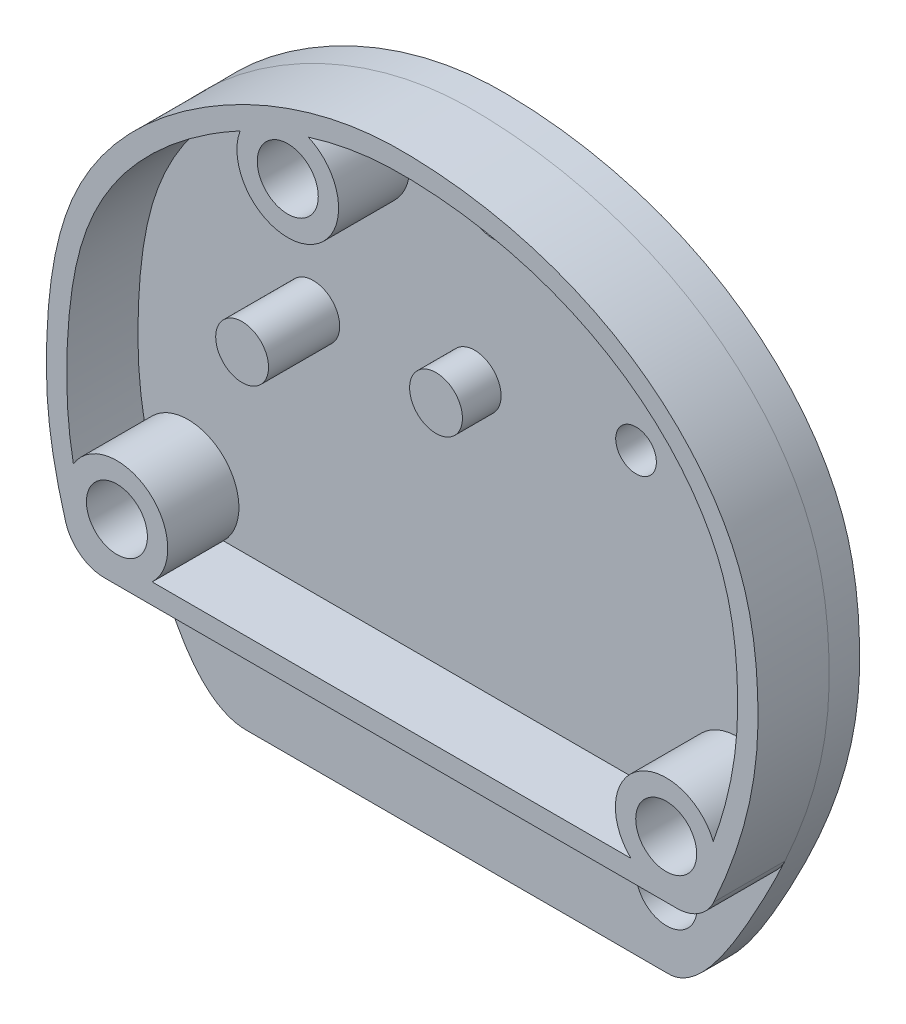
ISO-10303-21;
HEADER;
FILE_DESCRIPTION(('STEP AP214'),'2;1');
FILE_NAME('part.step','',(''),(''),'','','');
FILE_SCHEMA(('AUTOMOTIVE_DESIGN { 1 0 10303 214 1 1 1 1 }'));
ENDSEC;
DATA;
#1=APPLICATION_CONTEXT('core data for automotive mechanical design processes');
#2=APPLICATION_PROTOCOL_DEFINITION('international standard','automotive_design',2000,#1);
#3=PRODUCT_CONTEXT('',#1,'mechanical');
#4=PRODUCT('Part','Part','',(#3));
#5=PRODUCT_RELATED_PRODUCT_CATEGORY('part','',(#4));
#6=PRODUCT_DEFINITION_FORMATION('','',#4);
#7=PRODUCT_DEFINITION_CONTEXT('part definition',#1,'design');
#8=PRODUCT_DEFINITION('design','',#6,#7);
#9=PRODUCT_DEFINITION_SHAPE('','',#8);
#10=(LENGTH_UNIT() NAMED_UNIT(*) SI_UNIT(.MILLI.,.METRE.));
#11=(NAMED_UNIT(*) PLANE_ANGLE_UNIT() SI_UNIT($,.RADIAN.));
#12=(NAMED_UNIT(*) SI_UNIT($,.STERADIAN.) SOLID_ANGLE_UNIT());
#13=UNCERTAINTY_MEASURE_WITH_UNIT(LENGTH_MEASURE(1.E-05),#10,'distance_accuracy_value','');
#14=(GEOMETRIC_REPRESENTATION_CONTEXT(3) GLOBAL_UNCERTAINTY_ASSIGNED_CONTEXT((#13)) GLOBAL_UNIT_ASSIGNED_CONTEXT((#10,
#11,#12)) REPRESENTATION_CONTEXT('',''));
#15=CARTESIAN_POINT('',(0.,0.,0.));
#16=DIRECTION('',(0.,0.,1.));
#17=DIRECTION('',(1.,0.,0.));
#18=AXIS2_PLACEMENT_3D('',#15,#16,#17);
#19=CARTESIAN_POINT('',(-1.49450825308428,5.54250645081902,3.5));
#20=CARTESIAN_POINT('',(-1.5953175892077,5.88605308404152,3.5));
#21=CARTESIAN_POINT('',(-1.78764288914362,6.58789998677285,3.5));
#22=CARTESIAN_POINT('',(-2.09094383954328,7.91766389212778,3.5));
#23=CARTESIAN_POINT('',(-2.34407765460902,9.54222727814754,3.5));
#24=CARTESIAN_POINT('',(-2.42239712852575,11.5317924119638,3.5));
#25=CARTESIAN_POINT('',(-2.32309957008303,14.3980351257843,3.5));
#26=CARTESIAN_POINT('',(-1.78209325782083,17.8582865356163,3.5));
#27=CARTESIAN_POINT('',(0.0646065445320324,21.3932267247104,3.5));
#28=CARTESIAN_POINT('',(3.05839520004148,24.3711127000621,3.5));
#29=CARTESIAN_POINT('',(6.73487663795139,26.675611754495,3.5));
#30=CARTESIAN_POINT('',(10.0542104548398,27.878785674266,3.5));
#31=CARTESIAN_POINT('',(12.737228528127,28.3169879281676,3.5));
#32=CARTESIAN_POINT('',(15.4205692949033,28.3515467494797,3.5));
#33=CARTESIAN_POINT('',(18.9649524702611,27.9246297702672,3.5));
#34=CARTESIAN_POINT('',(22.9874672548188,26.5786026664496,3.5));
#35=CARTESIAN_POINT('',(26.5229410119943,24.3049221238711,3.5));
#36=CARTESIAN_POINT('',(28.7679292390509,21.6523952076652,3.5));
#37=CARTESIAN_POINT('',(29.9190852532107,19.2118556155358,3.5));
#38=CARTESIAN_POINT('',(30.4118310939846,17.2008095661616,3.5));
#39=CARTESIAN_POINT('',(30.5763357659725,15.4436026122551,3.5));
#40=CARTESIAN_POINT('',(30.6094587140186,14.1080941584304,3.5));
#41=CARTESIAN_POINT('',(30.5749402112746,12.2446341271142,3.5));
#42=CARTESIAN_POINT('',(30.2229204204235,10.0606266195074,3.5));
#43=CARTESIAN_POINT('',(29.4965053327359,7.78614003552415,3.5));
#44=CARTESIAN_POINT('',(28.9750160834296,6.44924835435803,3.5));
#45=CARTESIAN_POINT('',(28.6718382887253,5.75144658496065,3.5));
#46=CARTESIAN_POINT('',(28.5166633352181,5.41016498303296,3.5));
#47=B_SPLINE_CURVE_WITH_KNOTS('',3,(#19,#20,#21,#22,#23,#24,#25,#26,#27,#28,#29,#30,#31,#32,#33,
#34,#35,#36,#37,#38,#39,#40,#41,#42,#43,#44,#45,#46),.UNSPECIFIED.,.F.,.F.,(4,1,1,1,1,1,1,1,1,1,
1,1,1,1,1,1,1,1,1,1,1,1,1,1,1,4),(0.941741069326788,0.951709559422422,0.961678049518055,
0.981615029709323,1.00155200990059,1.02148899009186,1.0613629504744,1.10123691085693,
1.14111087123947,1.180984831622,1.22085879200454,1.24079577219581,1.26073275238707,
1.30060671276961,1.34048067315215,1.38035463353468,1.42022859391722,1.44016557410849,
1.46010255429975,1.48003953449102,1.49000802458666,1.49997651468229,1.53985047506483,
1.55978745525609,1.56975594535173,1.57972443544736),.UNSPECIFIED.);
#48=DIRECTION('',(0.,0.,-1.));
#49=VECTOR('',#48,1.);
#50=SURFACE_OF_LINEAR_EXTRUSION('',#47,#49);
#51=CARTESIAN_POINT('',(-2.07147938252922,7.91269841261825,3.5));
#52=VERTEX_POINT('',#51);
#53=CARTESIAN_POINT('',(6.13103381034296,26.196654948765,3.5));
#54=VERTEX_POINT('',#53);
#55=EDGE_CURVE('E167',#52,#54,#47,.T.);
#56=ORIENTED_EDGE('',*,*,#55,.F.);
#57=DIRECTION('',(0.,0.,-1.));
#58=VECTOR('',#57,1.);
#59=CARTESIAN_POINT('',(-2.07147938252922,7.91269841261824,3.5));
#60=LINE('',#59,#58);
#61=CARTESIAN_POINT('',(-2.07147938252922,7.91269841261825,0.));
#62=VERTEX_POINT('',#61);
#63=EDGE_CURVE('E315',#52,#62,#60,.T.);
#64=ORIENTED_EDGE('',*,*,#63,.T.);
#65=CARTESIAN_POINT('',(-1.49450825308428,5.54250645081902,0.));
#66=CARTESIAN_POINT('',(-1.5953175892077,5.88605308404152,0.));
#67=CARTESIAN_POINT('',(-1.78764288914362,6.58789998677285,0.));
#68=CARTESIAN_POINT('',(-2.09094383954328,7.91766389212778,0.));
#69=CARTESIAN_POINT('',(-2.34407765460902,9.54222727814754,0.));
#70=CARTESIAN_POINT('',(-2.42239712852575,11.5317924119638,0.));
#71=CARTESIAN_POINT('',(-2.32309957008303,14.3980351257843,0.));
#72=CARTESIAN_POINT('',(-1.78209325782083,17.8582865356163,0.));
#73=CARTESIAN_POINT('',(0.0646065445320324,21.3932267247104,0.));
#74=CARTESIAN_POINT('',(3.05839520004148,24.3711127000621,0.));
#75=CARTESIAN_POINT('',(6.73487663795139,26.675611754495,0.));
#76=CARTESIAN_POINT('',(10.0542104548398,27.878785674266,0.));
#77=CARTESIAN_POINT('',(12.737228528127,28.3169879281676,0.));
#78=CARTESIAN_POINT('',(15.4205692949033,28.3515467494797,0.));
#79=CARTESIAN_POINT('',(18.9649524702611,27.9246297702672,0.));
#80=CARTESIAN_POINT('',(22.9874672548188,26.5786026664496,0.));
#81=CARTESIAN_POINT('',(26.5229410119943,24.3049221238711,0.));
#82=CARTESIAN_POINT('',(28.7679292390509,21.6523952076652,0.));
#83=CARTESIAN_POINT('',(29.9190852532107,19.2118556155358,0.));
#84=CARTESIAN_POINT('',(30.4118310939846,17.2008095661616,0.));
#85=CARTESIAN_POINT('',(30.5763357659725,15.4436026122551,0.));
#86=CARTESIAN_POINT('',(30.6094587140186,14.1080941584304,0.));
#87=CARTESIAN_POINT('',(30.5749402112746,12.2446341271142,0.));
#88=CARTESIAN_POINT('',(30.2229204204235,10.0606266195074,0.));
#89=CARTESIAN_POINT('',(29.4965053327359,7.78614003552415,0.));
#90=CARTESIAN_POINT('',(28.9750160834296,6.44924835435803,0.));
#91=CARTESIAN_POINT('',(28.6718382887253,5.75144658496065,0.));
#92=CARTESIAN_POINT('',(28.5166633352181,5.41016498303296,0.));
#93=B_SPLINE_CURVE_WITH_KNOTS('',3,(#65,#66,#67,#68,#69,#70,#71,#72,#73,#74,#75,#76,#77,#78,#79,
#80,#81,#82,#83,#84,#85,#86,#87,#88,#89,#90,#91,#92),.UNSPECIFIED.,.F.,.F.,(4,1,1,1,1,1,1,1,1,1,
1,1,1,1,1,1,1,1,1,1,1,1,1,1,1,4),(0.941741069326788,0.951709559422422,0.961678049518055,
0.981615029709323,1.00155200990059,1.02148899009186,1.0613629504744,1.10123691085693,
1.14111087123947,1.180984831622,1.22085879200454,1.24079577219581,1.26073275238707,
1.30060671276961,1.34048067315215,1.38035463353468,1.42022859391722,1.44016557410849,
1.46010255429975,1.48003953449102,1.49000802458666,1.49997651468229,1.53985047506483,
1.55978745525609,1.56975594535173,1.57972443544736),.UNSPECIFIED.);
#94=CARTESIAN_POINT('',(6.13103381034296,26.196654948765,0.));
#95=VERTEX_POINT('',#94);
#96=EDGE_CURVE('E165',#62,#95,#93,.T.);
#97=ORIENTED_EDGE('',*,*,#96,.T.);
#98=DIRECTION('',(0.,0.,-1.));
#99=VECTOR('',#98,1.);
#100=CARTESIAN_POINT('',(6.13103381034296,26.196654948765,3.5));
#101=LINE('',#100,#99);
#102=EDGE_CURVE('E286',#95,#54,#101,.F.);
#103=ORIENTED_EDGE('',*,*,#102,.T.);
#104=EDGE_LOOP('',(#56,#64,#97,#103));
#105=FACE_BOUND('',#104,.T.);
#106=ADVANCED_FACE('F60',(#105),#50,.F.);
#107=CARTESIAN_POINT('',(31.5820135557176,13.1254710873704,0.));
#108=DIRECTION('',(0.,0.,-1.));
#109=DIRECTION('',(-1.,0.,0.));
#110=AXIS2_PLACEMENT_3D('',#107,#108,#109);
#111=PLANE('',#110);
#112=CARTESIAN_POINT('',(23.6028203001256,0.824071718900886,0.));
#113=DIRECTION('',(0.,0.,1.));
#114=DIRECTION('',(1.,0.,0.));
#115=AXIS2_PLACEMENT_3D('',#112,#113,#114);
#116=CIRCLE('',#115,1.5);
#117=CARTESIAN_POINT('',(25.1028203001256,0.824071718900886,0.));
#118=VERTEX_POINT('',#117);
#119=EDGE_CURVE('E223',#118,#118,#116,.T.);
#120=ORIENTED_EDGE('',*,*,#119,.F.);
#121=EDGE_LOOP('',(#120));
#122=FACE_BOUND('',#121,.T.);
#123=CARTESIAN_POINT('',(-0.534966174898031,5.82407171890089,0.));
#124=DIRECTION('',(0.,0.,1.));
#125=DIRECTION('',(1.,0.,0.));
#126=AXIS2_PLACEMENT_3D('',#123,#124,#125);
#127=CIRCLE('',#126,2.);
#128=CARTESIAN_POINT('',(-2.45405033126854,5.26094118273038,0.));
#129=VERTEX_POINT('',#128);
#130=CARTESIAN_POINT('',(-0.534966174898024,3.82407171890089,0.));
#131=VERTEX_POINT('',#130);
#132=EDGE_CURVE('E84',#129,#131,#127,.T.);
#133=ORIENTED_EDGE('',*,*,#132,.F.);
#134=CARTESIAN_POINT('',(-3.39717969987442,11.3940717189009,0.));
#135=CARTESIAN_POINT('',(-3.3955130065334,8.68662854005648,0.));
#136=CARTESIAN_POINT('',(-2.37048036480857,4.0551062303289,0.));
#137=CARTESIAN_POINT('',(0.543552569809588,-2.6791052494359,0.));
#138=CARTESIAN_POINT('',(9.44137784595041,-2.66737217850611,0.));
#139=CARTESIAN_POINT('',(18.8489862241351,-2.6673721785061,0.));
#140=CARTESIAN_POINT('',(25.1310998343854,-2.67846884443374,0.));
#141=CARTESIAN_POINT('',(29.7261899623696,4.57031544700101,0.));
#142=CARTESIAN_POINT('',(31.6067218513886,10.1134498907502,0.));
#143=CARTESIAN_POINT('',(31.6012560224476,15.5639673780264,0.));
#144=CARTESIAN_POINT('',(31.2272704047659,20.572792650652,0.));
#145=CARTESIAN_POINT('',(25.2670084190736,27.6598455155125,0.));
#146=CARTESIAN_POINT('',(17.9103775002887,29.3286394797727,0.));
#147=CARTESIAN_POINT('',(10.6728633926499,29.3202436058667,0.));
#148=CARTESIAN_POINT('',(4.09944910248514,27.0823658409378,0.));
#149=CARTESIAN_POINT('',(-2.8292419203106,20.1806584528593,0.));
#150=CARTESIAN_POINT('',(-3.39879696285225,14.0212182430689,0.));
#151=CARTESIAN_POINT('',(-3.39717969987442,11.3940717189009,0.));
#152=B_SPLINE_CURVE_WITH_KNOTS('',3,(#134,#135,#136,#137,#138,#139,#140,#141,#142,#143,#144,
#145,#146,#147,#148,#149,#150,#151),.UNSPECIFIED.,.T.,.F.,(4,1,2,2,1,2,1,1,2,1,1,4),(0.,
0.0750955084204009,0.145707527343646,0.335877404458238,0.392344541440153,0.508788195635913,
0.555474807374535,0.636980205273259,0.746884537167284,0.838992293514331,0.927131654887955,1.),.UNSPECIFIED.);
#153=CARTESIAN_POINT('',(29.4269826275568,4.99625824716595,0.));
#154=VERTEX_POINT('',#153);
#155=EDGE_CURVE('E240',#129,#154,#152,.T.);
#156=ORIENTED_EDGE('',*,*,#155,.T.);
#157=CARTESIAN_POINT('',(27.6063440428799,5.8240717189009,0.));
#158=DIRECTION('',(0.,0.,1.));
#159=DIRECTION('',(1.,0.,0.));
#160=AXIS2_PLACEMENT_3D('',#157,#158,#159);
#161=CIRCLE('',#160,2.);
#162=CARTESIAN_POINT('',(27.6063440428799,3.8240717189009,0.));
#163=VERTEX_POINT('',#162);
#164=EDGE_CURVE('E263',#163,#154,#161,.T.);
#165=ORIENTED_EDGE('',*,*,#164,.F.);
#166=DIRECTION('',(-1.,0.,0.));
#167=VECTOR('',#166,1.);
#168=CARTESIAN_POINT('',(27.6063440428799,3.8240717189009,0.));
#169=LINE('',#168,#167);
#170=EDGE_CURVE('E267',#163,#131,#169,.T.);
#171=ORIENTED_EDGE('',*,*,#170,.T.);
#172=EDGE_LOOP('',(#133,#156,#165,#171));
#173=FACE_BOUND('',#172,.T.);
#174=ADVANCED_FACE('F338',(#122,#173),#111,.F.);
#175=CARTESIAN_POINT('',(-3.39717969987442,11.3940717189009,-1.5));
#176=CARTESIAN_POINT('',(-3.3955130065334,8.68662854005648,-1.5));
#177=CARTESIAN_POINT('',(-2.37048036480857,4.0551062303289,-1.5));
#178=CARTESIAN_POINT('',(0.543552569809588,-2.6791052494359,-1.5));
#179=CARTESIAN_POINT('',(9.44137784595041,-2.66737217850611,-1.5));
#180=CARTESIAN_POINT('',(18.8489862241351,-2.6673721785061,-1.5));
#181=CARTESIAN_POINT('',(25.1310998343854,-2.67846884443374,-1.5));
#182=CARTESIAN_POINT('',(29.7261899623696,4.57031544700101,-1.5));
#183=CARTESIAN_POINT('',(31.6067218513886,10.1134498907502,-1.5));
#184=CARTESIAN_POINT('',(31.6012560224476,15.5639673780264,-1.5));
#185=CARTESIAN_POINT('',(31.2272704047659,20.572792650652,-1.5));
#186=CARTESIAN_POINT('',(25.2670084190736,27.6598455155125,-1.5));
#187=CARTESIAN_POINT('',(17.9103775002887,29.3286394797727,-1.5));
#188=CARTESIAN_POINT('',(10.6728633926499,29.3202436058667,-1.5));
#189=CARTESIAN_POINT('',(4.09944910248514,27.0823658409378,-1.5));
#190=CARTESIAN_POINT('',(-2.8292419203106,20.1806584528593,-1.5));
#191=CARTESIAN_POINT('',(-3.39879696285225,14.0212182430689,-1.5));
#192=CARTESIAN_POINT('',(-3.39717969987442,11.3940717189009,-1.5));
#193=B_SPLINE_CURVE_WITH_KNOTS('',3,(#175,#176,#177,#178,#179,#180,#181,#182,#183,#184,#185,
#186,#187,#188,#189,#190,#191,#192),.UNSPECIFIED.,.T.,.F.,(4,1,2,2,1,2,1,1,2,1,1,4),(0.,
0.0750955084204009,0.145707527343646,0.335877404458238,0.392344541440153,0.508788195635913,
0.555474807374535,0.636980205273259,0.746884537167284,0.838992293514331,0.927131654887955,1.),.UNSPECIFIED.);
#194=DIRECTION('',(0.,0.,1.));
#195=VECTOR('',#194,1.);
#196=SURFACE_OF_LINEAR_EXTRUSION('',#193,#195);
#197=CARTESIAN_POINT('',(-3.39717969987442,11.3940717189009,-1.5));
#198=VERTEX_POINT('',#197);
#199=EDGE_CURVE('E241',#198,#198,#193,.T.);
#200=ORIENTED_EDGE('',*,*,#199,.T.);
#201=EDGE_LOOP('',(#200));
#202=FACE_BOUND('',#201,.T.);
#203=ORIENTED_EDGE('',*,*,#155,.F.);
#204=CARTESIAN_POINT('',(-2.45405033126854,5.26094118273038,0.));
#205=CARTESIAN_POINT('',(-3.07764097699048,7.38606644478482,0.));
#206=CARTESIAN_POINT('',(-3.39588668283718,9.29364324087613,0.));
#207=CARTESIAN_POINT('',(-3.39717969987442,11.3940717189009,0.));
#208=CARTESIAN_POINT('',(-3.39879696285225,14.0212182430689,0.));
#209=CARTESIAN_POINT('',(-2.8292419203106,20.1806584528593,0.));
#210=CARTESIAN_POINT('',(4.09944910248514,27.0823658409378,0.));
#211=CARTESIAN_POINT('',(10.6728633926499,29.3202436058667,0.));
#212=CARTESIAN_POINT('',(17.9103775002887,29.3286394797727,0.));
#213=CARTESIAN_POINT('',(25.2670084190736,27.6598455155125,0.));
#214=CARTESIAN_POINT('',(31.2272704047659,20.572792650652,0.));
#215=CARTESIAN_POINT('',(31.6012560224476,15.5639673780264,0.));
#216=CARTESIAN_POINT('',(31.6057859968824,11.0466827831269,0.));
#217=CARTESIAN_POINT('',(30.874763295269,8.18041196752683,0.));
#218=CARTESIAN_POINT('',(29.4269826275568,4.99625824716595,0.));
#219=B_SPLINE_CURVE_WITH_KNOTS('',3,(#204,#205,#206,#207,#208,#209,#210,#211,#212,#213,#214,
#215,#216,#217,#218),.UNSPECIFIED.,.F.,.F.,(4,3,1,1,2,1,1,2,4),(0.941741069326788,1.,
1.07286834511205,1.16100770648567,1.25311546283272,1.36301979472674,1.44452519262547,
1.49121180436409,1.57972443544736),.UNSPECIFIED.);
#220=EDGE_CURVE('E266',#129,#154,#219,.T.);
#221=ORIENTED_EDGE('',*,*,#220,.T.);
#222=EDGE_LOOP('',(#203,#221));
#223=FACE_BOUND('',#222,.T.);
#224=ADVANCED_FACE('F62',(#202,#223),#196,.T.);
#225=CARTESIAN_POINT('',(31.5820135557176,13.1254710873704,-1.5));
#226=DIRECTION('',(0.,0.,-1.));
#227=DIRECTION('',(-1.,0.,0.));
#228=AXIS2_PLACEMENT_3D('',#225,#226,#227);
#229=PLANE('',#228);
#230=CARTESIAN_POINT('',(23.6028203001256,0.824071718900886,-1.5));
#231=DIRECTION('',(0.,0.,1.));
#232=DIRECTION('',(1.,0.,0.));
#233=AXIS2_PLACEMENT_3D('',#230,#231,#232);
#234=CIRCLE('',#233,1.5);
#235=CARTESIAN_POINT('',(25.1028203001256,0.824071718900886,-1.5));
#236=VERTEX_POINT('',#235);
#237=EDGE_CURVE('E226',#236,#236,#234,.T.);
#238=ORIENTED_EDGE('',*,*,#237,.T.);
#239=EDGE_LOOP('',(#238));
#240=FACE_BOUND('',#239,.T.);
#241=CARTESIAN_POINT('',(22.1028203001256,18.8240717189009,-1.5));
#242=DIRECTION('',(0.,0.,1.));
#243=DIRECTION('',(1.,0.,0.));
#244=AXIS2_PLACEMENT_3D('',#241,#242,#243);
#245=CIRCLE('',#244,1.);
#246=CARTESIAN_POINT('',(23.1028203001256,18.8240717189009,-1.5));
#247=VERTEX_POINT('',#246);
#248=EDGE_CURVE('E232',#247,#247,#245,.T.);
#249=ORIENTED_EDGE('',*,*,#248,.T.);
#250=EDGE_LOOP('',(#249));
#251=FACE_BOUND('',#250,.T.);
#252=CARTESIAN_POINT('',(15.1028203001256,25.8240717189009,-1.5));
#253=DIRECTION('',(0.,0.,1.));
#254=DIRECTION('',(1.,0.,0.));
#255=AXIS2_PLACEMENT_3D('',#252,#253,#254);
#256=CIRCLE('',#255,1.5);
#257=CARTESIAN_POINT('',(16.6028203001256,25.8240717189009,-1.5));
#258=VERTEX_POINT('',#257);
#259=EDGE_CURVE('E238',#258,#258,#256,.T.);
#260=ORIENTED_EDGE('',*,*,#259,.T.);
#261=EDGE_LOOP('',(#260));
#262=FACE_BOUND('',#261,.T.);
#263=ORIENTED_EDGE('',*,*,#199,.F.);
#264=EDGE_LOOP('',(#263));
#265=FACE_BOUND('',#264,.T.);
#266=ADVANCED_FACE('F348',(#240,#251,#262,#265),#229,.T.);
#267=CARTESIAN_POINT('',(6.22831243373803,16.8240717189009,0.));
#268=DIRECTION('',(0.,0.,-1.));
#269=DIRECTION('',(-1.,0.,0.));
#270=AXIS2_PLACEMENT_3D('',#267,#268,#269);
#271=CIRCLE('',#270,1.3);
#272=CARTESIAN_POINT('',(4.92831243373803,16.8240717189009,0.));
#273=VERTEX_POINT('',#272);
#274=EDGE_CURVE('E411',#273,#273,#271,.T.);
#275=ORIENTED_EDGE('',*,*,#274,.T.);
#276=EDGE_LOOP('',(#275));
#277=FACE_BOUND('',#276,.T.);
#278=CARTESIAN_POINT('',(14.1655663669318,17.8240717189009,0.));
#279=DIRECTION('',(0.,0.,-1.));
#280=DIRECTION('',(-1.,0.,0.));
#281=AXIS2_PLACEMENT_3D('',#278,#279,#280);
#282=CIRCLE('',#281,1.3);
#283=CARTESIAN_POINT('',(12.8655663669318,17.8240717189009,0.));
#284=VERTEX_POINT('',#283);
#285=EDGE_CURVE('E410',#284,#284,#282,.T.);
#286=ORIENTED_EDGE('',*,*,#285,.T.);
#287=EDGE_LOOP('',(#286));
#288=FACE_BOUND('',#287,.T.);
#289=DIRECTION('',(-1.,0.,0.));
#290=VECTOR('',#289,1.);
#291=CARTESIAN_POINT('',(27.6063440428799,4.8240717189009,0.));
#292=LINE('',#291,#290);
#293=CARTESIAN_POINT('',(25.3516953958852,4.8240717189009,0.));
#294=VERTEX_POINT('',#293);
#295=CARTESIAN_POINT('',(1.80575389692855,4.8240717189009,0.));
#296=VERTEX_POINT('',#295);
#297=EDGE_CURVE('E302',#294,#296,#292,.T.);
#298=ORIENTED_EDGE('',*,*,#297,.F.);
#299=CARTESIAN_POINT('',(27.0866305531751,6.62407171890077,0.));
#300=DIRECTION('',(0.,0.,-1.));
#301=DIRECTION('',(-1.,0.,0.));
#302=AXIS2_PLACEMENT_3D('',#299,#300,#301);
#303=CIRCLE('',#302,2.5);
#304=CARTESIAN_POINT('',(29.4010958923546,7.56919086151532,0.));
#305=VERTEX_POINT('',#304);
#306=EDGE_CURVE('E145',#294,#305,#303,.T.);
#307=ORIENTED_EDGE('',*,*,#306,.T.);
#308=CARTESIAN_POINT('',(9.4865536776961,27.609755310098,0.));
#309=VERTEX_POINT('',#308);
#310=EDGE_CURVE('E169',#309,#305,#93,.T.);
#311=ORIENTED_EDGE('',*,*,#310,.F.);
#312=CARTESIAN_POINT('',(8.47380962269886,25.3240717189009,0.));
#313=DIRECTION('',(0.,0.,-1.));
#314=DIRECTION('',(-1.,0.,0.));
#315=AXIS2_PLACEMENT_3D('',#312,#313,#314);
#316=CIRCLE('',#315,2.5);
#317=EDGE_CURVE('E318',#309,#95,#316,.T.);
#318=ORIENTED_EDGE('',*,*,#317,.T.);
#319=ORIENTED_EDGE('',*,*,#96,.F.);
#320=CARTESIAN_POINT('',(0.0708187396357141,6.62407171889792,0.));
#321=DIRECTION('',(0.,0.,-1.));
#322=DIRECTION('',(-1.,0.,0.));
#323=AXIS2_PLACEMENT_3D('',#320,#321,#322);
#324=CIRCLE('',#323,2.5);
#325=EDGE_CURVE('E309',#62,#296,#324,.T.);
#326=ORIENTED_EDGE('',*,*,#325,.T.);
#327=EDGE_LOOP('',(#298,#307,#311,#318,#319,#326));
#328=FACE_BOUND('',#327,.T.);
#329=CARTESIAN_POINT('',(22.1028203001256,18.8240717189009,0.));
#330=DIRECTION('',(0.,0.,1.));
#331=DIRECTION('',(1.,0.,0.));
#332=AXIS2_PLACEMENT_3D('',#329,#330,#331);
#333=CIRCLE('',#332,1.);
#334=CARTESIAN_POINT('',(23.1028203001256,18.8240717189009,0.));
#335=VERTEX_POINT('',#334);
#336=EDGE_CURVE('E229',#335,#335,#333,.T.);
#337=ORIENTED_EDGE('',*,*,#336,.F.);
#338=EDGE_LOOP('',(#337));
#339=FACE_BOUND('',#338,.T.);
#340=CARTESIAN_POINT('',(15.1028203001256,25.8240717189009,0.));
#341=DIRECTION('',(0.,0.,1.));
#342=DIRECTION('',(1.,0.,0.));
#343=AXIS2_PLACEMENT_3D('',#340,#341,#342);
#344=CIRCLE('',#343,1.5);
#345=CARTESIAN_POINT('',(16.6028203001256,25.8240717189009,0.));
#346=VERTEX_POINT('',#345);
#347=EDGE_CURVE('E235',#346,#346,#344,.T.);
#348=ORIENTED_EDGE('',*,*,#347,.F.);
#349=EDGE_LOOP('',(#348));
#350=FACE_BOUND('',#349,.T.);
#351=ADVANCED_FACE('F298',(#277,#288,#328,#339,#350),#111,.F.);
#352=CARTESIAN_POINT('',(15.1028203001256,25.8240717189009,-1.5));
#353=DIRECTION('',(0.,0.,1.));
#354=DIRECTION('',(1.,0.,0.));
#355=AXIS2_PLACEMENT_3D('',#352,#353,#354);
#356=CYLINDRICAL_SURFACE('',#355,1.5);
#357=ORIENTED_EDGE('',*,*,#259,.F.);
#358=EDGE_LOOP('',(#357));
#359=FACE_BOUND('',#358,.T.);
#360=ORIENTED_EDGE('',*,*,#347,.T.);
#361=EDGE_LOOP('',(#360));
#362=FACE_BOUND('',#361,.T.);
#363=ADVANCED_FACE('F354',(#359,#362),#356,.F.);
#364=CARTESIAN_POINT('',(22.1028203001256,18.8240717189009,-1.5));
#365=DIRECTION('',(0.,0.,1.));
#366=DIRECTION('',(1.,0.,0.));
#367=AXIS2_PLACEMENT_3D('',#364,#365,#366);
#368=CYLINDRICAL_SURFACE('',#367,1.);
#369=ORIENTED_EDGE('',*,*,#248,.F.);
#370=EDGE_LOOP('',(#369));
#371=FACE_BOUND('',#370,.T.);
#372=ORIENTED_EDGE('',*,*,#336,.T.);
#373=EDGE_LOOP('',(#372));
#374=FACE_BOUND('',#373,.T.);
#375=ADVANCED_FACE('F521',(#371,#374),#368,.F.);
#376=CARTESIAN_POINT('',(23.6028203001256,0.824071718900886,-1.5));
#377=DIRECTION('',(0.,0.,1.));
#378=DIRECTION('',(1.,0.,0.));
#379=AXIS2_PLACEMENT_3D('',#376,#377,#378);
#380=CYLINDRICAL_SURFACE('',#379,1.5);
#381=ORIENTED_EDGE('',*,*,#237,.F.);
#382=EDGE_LOOP('',(#381));
#383=FACE_BOUND('',#382,.T.);
#384=ORIENTED_EDGE('',*,*,#119,.T.);
#385=EDGE_LOOP('',(#384));
#386=FACE_BOUND('',#385,.T.);
#387=ADVANCED_FACE('F198',(#383,#386),#380,.F.);
#388=CARTESIAN_POINT('',(-0.534966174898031,5.82407171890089,3.5));
#389=DIRECTION('',(0.,0.,1.));
#390=DIRECTION('',(1.,0.,0.));
#391=AXIS2_PLACEMENT_3D('',#388,#389,#390);
#392=PLANE('',#391);
#393=CARTESIAN_POINT('',(9.48655367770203,27.6097553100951,3.5));
#394=VERTEX_POINT('',#393);
#395=CARTESIAN_POINT('',(29.4010958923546,7.56919086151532,3.5));
#396=VERTEX_POINT('',#395);
#397=EDGE_CURVE('E158',#394,#396,#47,.T.);
#398=ORIENTED_EDGE('',*,*,#397,.T.);
#399=CARTESIAN_POINT('',(27.0866305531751,6.62407171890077,3.5));
#400=DIRECTION('',(0.,0.,1.));
#401=DIRECTION('',(1.,0.,0.));
#402=AXIS2_PLACEMENT_3D('',#399,#400,#401);
#403=CIRCLE('',#402,2.5);
#404=CARTESIAN_POINT('',(25.3516953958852,4.8240717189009,3.5));
#405=VERTEX_POINT('',#404);
#406=EDGE_CURVE('E142',#405,#396,#403,.F.);
#407=ORIENTED_EDGE('',*,*,#406,.F.);
#408=DIRECTION('',(-1.,0.,0.));
#409=VECTOR('',#408,1.);
#410=CARTESIAN_POINT('',(27.6063440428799,4.8240717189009,3.5));
#411=LINE('',#410,#409);
#412=CARTESIAN_POINT('',(1.80575389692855,4.8240717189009,3.5));
#413=VERTEX_POINT('',#412);
#414=EDGE_CURVE('E155',#405,#413,#411,.T.);
#415=ORIENTED_EDGE('',*,*,#414,.T.);
#416=CARTESIAN_POINT('',(0.0708187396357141,6.62407171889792,3.5));
#417=DIRECTION('',(0.,0.,1.));
#418=DIRECTION('',(1.,0.,0.));
#419=AXIS2_PLACEMENT_3D('',#416,#417,#418);
#420=CIRCLE('',#419,2.5);
#421=EDGE_CURVE('E149',#52,#413,#420,.F.);
#422=ORIENTED_EDGE('',*,*,#421,.F.);
#423=ORIENTED_EDGE('',*,*,#55,.T.);
#424=CARTESIAN_POINT('',(8.47380962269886,25.3240717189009,3.5));
#425=DIRECTION('',(0.,0.,1.));
#426=DIRECTION('',(1.,0.,0.));
#427=AXIS2_PLACEMENT_3D('',#424,#425,#426);
#428=CIRCLE('',#427,2.5);
#429=EDGE_CURVE('E76',#394,#54,#428,.F.);
#430=ORIENTED_EDGE('',*,*,#429,.F.);
#431=EDGE_LOOP('',(#398,#407,#415,#422,#423,#430));
#432=FACE_BOUND('',#431,.T.);
#433=CARTESIAN_POINT('',(-0.534966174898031,5.82407171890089,3.5));
#434=DIRECTION('',(0.,0.,1.));
#435=DIRECTION('',(1.,0.,0.));
#436=AXIS2_PLACEMENT_3D('',#433,#434,#435);
#437=CIRCLE('',#436,2.);
#438=CARTESIAN_POINT('',(-2.45405033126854,5.26094118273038,3.5));
#439=VERTEX_POINT('',#438);
#440=CARTESIAN_POINT('',(-0.534966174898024,3.82407171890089,3.5));
#441=VERTEX_POINT('',#440);
#442=EDGE_CURVE('E272',#439,#441,#437,.T.);
#443=ORIENTED_EDGE('',*,*,#442,.T.);
#444=DIRECTION('',(-1.,0.,0.));
#445=VECTOR('',#444,1.);
#446=CARTESIAN_POINT('',(27.6063440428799,3.8240717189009,3.5));
#447=LINE('',#446,#445);
#448=CARTESIAN_POINT('',(27.6063440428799,3.8240717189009,3.5));
#449=VERTEX_POINT('',#448);
#450=EDGE_CURVE('E554',#449,#441,#447,.T.);
#451=ORIENTED_EDGE('',*,*,#450,.F.);
#452=CARTESIAN_POINT('',(27.6063440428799,5.8240717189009,3.5));
#453=DIRECTION('',(0.,0.,1.));
#454=DIRECTION('',(1.,0.,0.));
#455=AXIS2_PLACEMENT_3D('',#452,#453,#454);
#456=CIRCLE('',#455,2.);
#457=CARTESIAN_POINT('',(29.4269826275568,4.99625824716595,3.5));
#458=VERTEX_POINT('',#457);
#459=EDGE_CURVE('E213',#449,#458,#456,.T.);
#460=ORIENTED_EDGE('',*,*,#459,.T.);
#461=CARTESIAN_POINT('',(-2.45405033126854,5.26094118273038,3.5));
#462=CARTESIAN_POINT('',(-3.07764097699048,7.38606644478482,3.5));
#463=CARTESIAN_POINT('',(-3.39588668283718,9.29364324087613,3.5));
#464=CARTESIAN_POINT('',(-3.39717969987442,11.3940717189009,3.5));
#465=CARTESIAN_POINT('',(-3.39879696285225,14.0212182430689,3.5));
#466=CARTESIAN_POINT('',(-2.8292419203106,20.1806584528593,3.5));
#467=CARTESIAN_POINT('',(4.09944910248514,27.0823658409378,3.5));
#468=CARTESIAN_POINT('',(10.6728633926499,29.3202436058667,3.5));
#469=CARTESIAN_POINT('',(17.9103775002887,29.3286394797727,3.5));
#470=CARTESIAN_POINT('',(25.2670084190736,27.6598455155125,3.5));
#471=CARTESIAN_POINT('',(31.2272704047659,20.572792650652,3.5));
#472=CARTESIAN_POINT('',(31.6012560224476,15.5639673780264,3.5));
#473=CARTESIAN_POINT('',(31.6057859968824,11.0466827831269,3.5));
#474=CARTESIAN_POINT('',(30.874763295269,8.18041196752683,3.5));
#475=CARTESIAN_POINT('',(29.4269826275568,4.99625824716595,3.5));
#476=B_SPLINE_CURVE_WITH_KNOTS('',3,(#461,#462,#463,#464,#465,#466,#467,#468,#469,#470,#471,
#472,#473,#474,#475),.UNSPECIFIED.,.F.,.F.,(4,3,1,1,2,1,1,2,4),(0.941741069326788,1.,
1.07286834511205,1.16100770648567,1.25311546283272,1.36301979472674,1.44452519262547,
1.49121180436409,1.57972443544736),.UNSPECIFIED.);
#477=EDGE_CURVE('E205',#439,#458,#476,.T.);
#478=ORIENTED_EDGE('',*,*,#477,.F.);
#479=EDGE_LOOP('',(#443,#451,#460,#478));
#480=FACE_BOUND('',#479,.T.);
#481=CARTESIAN_POINT('',(8.47380962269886,25.3240717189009,3.5));
#482=DIRECTION('',(0.,0.,1.));
#483=DIRECTION('',(1.,0.,0.));
#484=AXIS2_PLACEMENT_3D('',#481,#482,#483);
#485=CIRCLE('',#484,1.5);
#486=CARTESIAN_POINT('',(9.97380962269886,25.3240717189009,3.5));
#487=VERTEX_POINT('',#486);
#488=EDGE_CURVE('E320',#487,#487,#485,.F.);
#489=ORIENTED_EDGE('',*,*,#488,.T.);
#490=EDGE_LOOP('',(#489));
#491=FACE_BOUND('',#490,.T.);
#492=CARTESIAN_POINT('',(0.0708187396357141,6.62407171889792,3.5));
#493=DIRECTION('',(0.,0.,1.));
#494=DIRECTION('',(1.,0.,0.));
#495=AXIS2_PLACEMENT_3D('',#492,#493,#494);
#496=CIRCLE('',#495,1.5);
#497=CARTESIAN_POINT('',(1.57081873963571,6.62407171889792,3.5));
#498=VERTEX_POINT('',#497);
#499=EDGE_CURVE('E311',#498,#498,#496,.F.);
#500=ORIENTED_EDGE('',*,*,#499,.T.);
#501=EDGE_LOOP('',(#500));
#502=FACE_BOUND('',#501,.T.);
#503=CARTESIAN_POINT('',(27.0866305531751,6.62407171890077,3.5));
#504=DIRECTION('',(0.,0.,1.));
#505=DIRECTION('',(1.,0.,0.));
#506=AXIS2_PLACEMENT_3D('',#503,#504,#505);
#507=CIRCLE('',#506,1.5);
#508=CARTESIAN_POINT('',(28.5866305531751,6.62407171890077,3.5));
#509=VERTEX_POINT('',#508);
#510=EDGE_CURVE('E150',#509,#509,#507,.F.);
#511=ORIENTED_EDGE('',*,*,#510,.T.);
#512=EDGE_LOOP('',(#511));
#513=FACE_BOUND('',#512,.T.);
#514=ADVANCED_FACE('F152',(#432,#480,#491,#502,#513),#392,.T.);
#515=CARTESIAN_POINT('',(-0.534966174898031,5.82407171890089,3.5));
#516=DIRECTION('',(0.,0.,-1.));
#517=DIRECTION('',(-1.,0.,0.));
#518=AXIS2_PLACEMENT_3D('',#515,#516,#517);
#519=CYLINDRICAL_SURFACE('',#518,2.);
#520=ORIENTED_EDGE('',*,*,#132,.T.);
#521=DIRECTION('',(0.,0.,-1.));
#522=VECTOR('',#521,1.);
#523=CARTESIAN_POINT('',(-0.534966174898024,3.82407171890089,3.5));
#524=LINE('',#523,#522);
#525=EDGE_CURVE('E220',#441,#131,#524,.T.);
#526=ORIENTED_EDGE('',*,*,#525,.F.);
#527=ORIENTED_EDGE('',*,*,#442,.F.);
#528=DIRECTION('',(0.,0.,-1.));
#529=VECTOR('',#528,1.);
#530=CARTESIAN_POINT('',(-2.45405033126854,5.26094118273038,3.5));
#531=LINE('',#530,#529);
#532=EDGE_CURVE('E212',#439,#129,#531,.T.);
#533=ORIENTED_EDGE('',*,*,#532,.T.);
#534=EDGE_LOOP('',(#520,#526,#527,#533));
#535=FACE_BOUND('',#534,.T.);
#536=ADVANCED_FACE('F197',(#535),#519,.T.);
#537=CARTESIAN_POINT('',(27.6063440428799,3.8240717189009,3.5));
#538=DIRECTION('',(0.,-1.,0.));
#539=DIRECTION('',(1.,0.,0.));
#540=AXIS2_PLACEMENT_3D('',#537,#538,#539);
#541=PLANE('',#540);
#542=ORIENTED_EDGE('',*,*,#170,.F.);
#543=DIRECTION('',(0.,0.,-1.));
#544=VECTOR('',#543,1.);
#545=CARTESIAN_POINT('',(27.6063440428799,3.8240717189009,3.5));
#546=LINE('',#545,#544);
#547=EDGE_CURVE('E215',#449,#163,#546,.T.);
#548=ORIENTED_EDGE('',*,*,#547,.F.);
#549=ORIENTED_EDGE('',*,*,#450,.T.);
#550=ORIENTED_EDGE('',*,*,#525,.T.);
#551=EDGE_LOOP('',(#542,#548,#549,#550));
#552=FACE_BOUND('',#551,.T.);
#553=ADVANCED_FACE('F496',(#552),#541,.T.);
#554=CARTESIAN_POINT('',(27.6063440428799,5.8240717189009,3.5));
#555=DIRECTION('',(0.,0.,-1.));
#556=DIRECTION('',(-1.,0.,0.));
#557=AXIS2_PLACEMENT_3D('',#554,#555,#556);
#558=CYLINDRICAL_SURFACE('',#557,2.);
#559=ORIENTED_EDGE('',*,*,#164,.T.);
#560=DIRECTION('',(0.,0.,-1.));
#561=VECTOR('',#560,1.);
#562=CARTESIAN_POINT('',(29.4269826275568,4.99625824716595,3.5));
#563=LINE('',#562,#561);
#564=EDGE_CURVE('E221',#458,#154,#563,.T.);
#565=ORIENTED_EDGE('',*,*,#564,.F.);
#566=ORIENTED_EDGE('',*,*,#459,.F.);
#567=ORIENTED_EDGE('',*,*,#547,.T.);
#568=EDGE_LOOP('',(#559,#565,#566,#567));
#569=FACE_BOUND('',#568,.T.);
#570=ADVANCED_FACE('F202',(#569),#558,.T.);
#571=DIRECTION('',(0.,0.,-1.));
#572=VECTOR('',#571,1.);
#573=SURFACE_OF_LINEAR_EXTRUSION('',#476,#572);
#574=ORIENTED_EDGE('',*,*,#220,.F.);
#575=ORIENTED_EDGE('',*,*,#532,.F.);
#576=ORIENTED_EDGE('',*,*,#477,.T.);
#577=ORIENTED_EDGE('',*,*,#564,.T.);
#578=EDGE_LOOP('',(#574,#575,#576,#577));
#579=FACE_BOUND('',#578,.T.);
#580=ADVANCED_FACE('F194',(#579),#573,.T.);
#581=CARTESIAN_POINT('',(27.6063440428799,4.8240717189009,3.5));
#582=DIRECTION('',(0.,-1.,0.));
#583=DIRECTION('',(1.,0.,0.));
#584=AXIS2_PLACEMENT_3D('',#581,#582,#583);
#585=PLANE('',#584);
#586=ORIENTED_EDGE('',*,*,#414,.F.);
#587=DIRECTION('',(0.,0.,-1.));
#588=VECTOR('',#587,1.);
#589=CARTESIAN_POINT('',(25.3516953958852,4.8240717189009,10.5710678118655));
#590=LINE('',#589,#588);
#591=EDGE_CURVE('E139',#405,#294,#590,.T.);
#592=ORIENTED_EDGE('',*,*,#591,.T.);
#593=ORIENTED_EDGE('',*,*,#297,.T.);
#594=DIRECTION('',(0.,0.,-1.));
#595=VECTOR('',#594,1.);
#596=CARTESIAN_POINT('',(1.80575389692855,4.8240717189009,10.5710678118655));
#597=LINE('',#596,#595);
#598=EDGE_CURVE('E164',#296,#413,#597,.F.);
#599=ORIENTED_EDGE('',*,*,#598,.T.);
#600=EDGE_LOOP('',(#586,#592,#593,#599));
#601=FACE_BOUND('',#600,.T.);
#602=ADVANCED_FACE('F162',(#601),#585,.F.);
#603=ORIENTED_EDGE('',*,*,#310,.T.);
#604=DIRECTION('',(0.,0.,-1.));
#605=VECTOR('',#604,1.);
#606=CARTESIAN_POINT('',(29.4010958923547,7.56919086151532,3.5));
#607=LINE('',#606,#605);
#608=EDGE_CURVE('E69',#305,#396,#607,.F.);
#609=ORIENTED_EDGE('',*,*,#608,.T.);
#610=ORIENTED_EDGE('',*,*,#397,.F.);
#611=DIRECTION('',(0.,0.,-1.));
#612=VECTOR('',#611,1.);
#613=CARTESIAN_POINT('',(9.48655367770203,27.6097553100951,3.5));
#614=LINE('',#613,#612);
#615=EDGE_CURVE('E247',#394,#309,#614,.T.);
#616=ORIENTED_EDGE('',*,*,#615,.T.);
#617=EDGE_LOOP('',(#603,#609,#610,#616));
#618=FACE_BOUND('',#617,.T.);
#619=ADVANCED_FACE('F184',(#618),#50,.F.);
#620=CARTESIAN_POINT('',(8.47380962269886,25.3240717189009,10.5710678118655));
#621=DIRECTION('',(0.,0.,-1.));
#622=DIRECTION('',(-1.,0.,0.));
#623=AXIS2_PLACEMENT_3D('',#620,#621,#622);
#624=CYLINDRICAL_SURFACE('',#623,2.5);
#625=ORIENTED_EDGE('',*,*,#102,.F.);
#626=ORIENTED_EDGE('',*,*,#317,.F.);
#627=ORIENTED_EDGE('',*,*,#615,.F.);
#628=ORIENTED_EDGE('',*,*,#429,.T.);
#629=EDGE_LOOP('',(#625,#626,#627,#628));
#630=FACE_BOUND('',#629,.T.);
#631=ADVANCED_FACE('F188',(#630),#624,.T.);
#632=CARTESIAN_POINT('',(8.47380962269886,25.3240717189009,10.5710678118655));
#633=DIRECTION('',(0.,0.,-1.));
#634=DIRECTION('',(-1.,0.,0.));
#635=AXIS2_PLACEMENT_3D('',#632,#633,#634);
#636=CYLINDRICAL_SURFACE('',#635,1.5);
#637=CARTESIAN_POINT('',(8.47380962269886,25.3240717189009,0.));
#638=DIRECTION('',(0.,0.,-1.));
#639=DIRECTION('',(-1.,0.,0.));
#640=AXIS2_PLACEMENT_3D('',#637,#638,#639);
#641=CIRCLE('',#640,1.5);
#642=CARTESIAN_POINT('',(6.97380962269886,25.3240717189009,0.));
#643=VERTEX_POINT('',#642);
#644=EDGE_CURVE('E289',#643,#643,#641,.T.);
#645=ORIENTED_EDGE('',*,*,#644,.T.);
#646=EDGE_LOOP('',(#645));
#647=FACE_BOUND('',#646,.T.);
#648=ORIENTED_EDGE('',*,*,#488,.F.);
#649=EDGE_LOOP('',(#648));
#650=FACE_BOUND('',#649,.T.);
#651=ADVANCED_FACE('F190',(#647,#650),#636,.F.);
#652=ORIENTED_EDGE('',*,*,#644,.F.);
#653=EDGE_LOOP('',(#652));
#654=FACE_BOUND('',#653,.T.);
#655=ADVANCED_FACE('F334',(#654),#111,.F.);
#656=CARTESIAN_POINT('',(0.0708187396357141,6.62407171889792,10.5710678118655));
#657=DIRECTION('',(0.,0.,-1.));
#658=DIRECTION('',(-1.,0.,0.));
#659=AXIS2_PLACEMENT_3D('',#656,#657,#658);
#660=CYLINDRICAL_SURFACE('',#659,2.5);
#661=ORIENTED_EDGE('',*,*,#63,.F.);
#662=ORIENTED_EDGE('',*,*,#421,.T.);
#663=ORIENTED_EDGE('',*,*,#598,.F.);
#664=ORIENTED_EDGE('',*,*,#325,.F.);
#665=EDGE_LOOP('',(#661,#662,#663,#664));
#666=FACE_BOUND('',#665,.T.);
#667=ADVANCED_FACE('F324',(#666),#660,.T.);
#668=CARTESIAN_POINT('',(0.0708187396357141,6.62407171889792,10.5710678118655));
#669=DIRECTION('',(0.,0.,-1.));
#670=DIRECTION('',(-1.,0.,0.));
#671=AXIS2_PLACEMENT_3D('',#668,#669,#670);
#672=CYLINDRICAL_SURFACE('',#671,1.5);
#673=CARTESIAN_POINT('',(0.0708187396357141,6.62407171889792,0.));
#674=DIRECTION('',(0.,0.,-1.));
#675=DIRECTION('',(-1.,0.,0.));
#676=AXIS2_PLACEMENT_3D('',#673,#674,#675);
#677=CIRCLE('',#676,1.5);
#678=CARTESIAN_POINT('',(-1.42918126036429,6.62407171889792,0.));
#679=VERTEX_POINT('',#678);
#680=EDGE_CURVE('E293',#679,#679,#677,.T.);
#681=ORIENTED_EDGE('',*,*,#680,.T.);
#682=EDGE_LOOP('',(#681));
#683=FACE_BOUND('',#682,.T.);
#684=ORIENTED_EDGE('',*,*,#499,.F.);
#685=EDGE_LOOP('',(#684));
#686=FACE_BOUND('',#685,.T.);
#687=ADVANCED_FACE('F363',(#683,#686),#672,.F.);
#688=ORIENTED_EDGE('',*,*,#680,.F.);
#689=EDGE_LOOP('',(#688));
#690=FACE_BOUND('',#689,.T.);
#691=ADVANCED_FACE('F359',(#690),#111,.F.);
#692=CARTESIAN_POINT('',(27.0866305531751,6.62407171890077,10.5710678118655));
#693=DIRECTION('',(0.,0.,-1.));
#694=DIRECTION('',(-1.,0.,0.));
#695=AXIS2_PLACEMENT_3D('',#692,#693,#694);
#696=CYLINDRICAL_SURFACE('',#695,2.5);
#697=ORIENTED_EDGE('',*,*,#591,.F.);
#698=ORIENTED_EDGE('',*,*,#406,.T.);
#699=ORIENTED_EDGE('',*,*,#608,.F.);
#700=ORIENTED_EDGE('',*,*,#306,.F.);
#701=EDGE_LOOP('',(#697,#698,#699,#700));
#702=FACE_BOUND('',#701,.T.);
#703=ADVANCED_FACE('F141',(#702),#696,.T.);
#704=CARTESIAN_POINT('',(27.0866305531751,6.62407171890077,10.5710678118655));
#705=DIRECTION('',(0.,0.,-1.));
#706=DIRECTION('',(-1.,0.,0.));
#707=AXIS2_PLACEMENT_3D('',#704,#705,#706);
#708=CYLINDRICAL_SURFACE('',#707,1.5);
#709=CARTESIAN_POINT('',(27.0866305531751,6.62407171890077,0.));
#710=DIRECTION('',(0.,0.,-1.));
#711=DIRECTION('',(-1.,0.,0.));
#712=AXIS2_PLACEMENT_3D('',#709,#710,#711);
#713=CIRCLE('',#712,1.5);
#714=CARTESIAN_POINT('',(25.5866305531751,6.62407171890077,0.));
#715=VERTEX_POINT('',#714);
#716=EDGE_CURVE('E12',#715,#715,#713,.T.);
#717=ORIENTED_EDGE('',*,*,#716,.T.);
#718=EDGE_LOOP('',(#717));
#719=FACE_BOUND('',#718,.T.);
#720=ORIENTED_EDGE('',*,*,#510,.F.);
#721=EDGE_LOOP('',(#720));
#722=FACE_BOUND('',#721,.T.);
#723=ADVANCED_FACE('F372',(#719,#722),#708,.F.);
#724=ORIENTED_EDGE('',*,*,#716,.F.);
#725=EDGE_LOOP('',(#724));
#726=FACE_BOUND('',#725,.T.);
#727=ADVANCED_FACE('F356',(#726),#111,.F.);
#728=CARTESIAN_POINT('',(14.1655663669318,17.8240717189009,1.9));
#729=DIRECTION('',(0.,0.,-1.));
#730=DIRECTION('',(-1.,0.,0.));
#731=AXIS2_PLACEMENT_3D('',#728,#729,#730);
#732=CYLINDRICAL_SURFACE('',#731,1.3);
#733=CARTESIAN_POINT('',(14.1655663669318,17.8240717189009,1.9));
#734=DIRECTION('',(0.,0.,-1.));
#735=DIRECTION('',(-1.,0.,0.));
#736=AXIS2_PLACEMENT_3D('',#733,#734,#735);
#737=CIRCLE('',#736,1.3);
#738=CARTESIAN_POINT('',(12.8655663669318,17.8240717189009,1.9));
#739=VERTEX_POINT('',#738);
#740=EDGE_CURVE('E159',#739,#739,#737,.T.);
#741=CARTESIAN_POINT('',(12.8655663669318,17.8240717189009,1.9));
#742=CARTESIAN_POINT('',(12.8655663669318,17.8240717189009,1.88020833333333));
#743=CARTESIAN_POINT('',(12.8655663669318,17.8240717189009,1.86041666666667));
#744=CARTESIAN_POINT('',(12.8655663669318,17.8240717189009,1.82083333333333));
#745=CARTESIAN_POINT('',(12.8655663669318,17.8240717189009,1.80104166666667));
#746=CARTESIAN_POINT('',(12.8655663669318,17.8240717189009,1.76145833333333));
#747=CARTESIAN_POINT('',(12.8655663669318,17.8240717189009,1.74166666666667));
#748=CARTESIAN_POINT('',(12.8655663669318,17.8240717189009,1.70208333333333));
#749=CARTESIAN_POINT('',(12.8655663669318,17.8240717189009,1.68229166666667));
#750=CARTESIAN_POINT('',(12.8655663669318,17.8240717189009,1.64270833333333));
#751=CARTESIAN_POINT('',(12.8655663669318,17.8240717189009,1.62291666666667));
#752=CARTESIAN_POINT('',(12.8655663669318,17.8240717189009,1.58333333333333));
#753=CARTESIAN_POINT('',(12.8655663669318,17.8240717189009,1.56354166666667));
#754=CARTESIAN_POINT('',(12.8655663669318,17.8240717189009,1.52395833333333));
#755=CARTESIAN_POINT('',(12.8655663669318,17.8240717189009,1.50416666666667));
#756=CARTESIAN_POINT('',(12.8655663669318,17.8240717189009,1.46458333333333));
#757=CARTESIAN_POINT('',(12.8655663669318,17.8240717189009,1.44479166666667));
#758=CARTESIAN_POINT('',(12.8655663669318,17.8240717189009,1.40520833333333));
#759=CARTESIAN_POINT('',(12.8655663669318,17.8240717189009,1.38541666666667));
#760=CARTESIAN_POINT('',(12.8655663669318,17.8240717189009,1.34583333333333));
#761=CARTESIAN_POINT('',(12.8655663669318,17.8240717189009,1.32604166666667));
#762=CARTESIAN_POINT('',(12.8655663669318,17.8240717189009,1.28645833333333));
#763=CARTESIAN_POINT('',(12.8655663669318,17.8240717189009,1.26666666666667));
#764=CARTESIAN_POINT('',(12.8655663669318,17.8240717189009,1.22708333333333));
#765=CARTESIAN_POINT('',(12.8655663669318,17.8240717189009,1.20729166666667));
#766=CARTESIAN_POINT('',(12.8655663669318,17.8240717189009,1.16770833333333));
#767=CARTESIAN_POINT('',(12.8655663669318,17.8240717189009,1.14791666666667));
#768=CARTESIAN_POINT('',(12.8655663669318,17.8240717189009,1.10833333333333));
#769=CARTESIAN_POINT('',(12.8655663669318,17.8240717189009,1.08854166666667));
#770=CARTESIAN_POINT('',(12.8655663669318,17.8240717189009,1.04895833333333));
#771=CARTESIAN_POINT('',(12.8655663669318,17.8240717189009,1.02916666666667));
#772=CARTESIAN_POINT('',(12.8655663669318,17.8240717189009,0.989583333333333));
#773=CARTESIAN_POINT('',(12.8655663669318,17.8240717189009,0.969791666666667));
#774=CARTESIAN_POINT('',(12.8655663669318,17.8240717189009,0.930208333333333));
#775=CARTESIAN_POINT('',(12.8655663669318,17.8240717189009,0.910416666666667));
#776=CARTESIAN_POINT('',(12.8655663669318,17.8240717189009,0.870833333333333));
#777=CARTESIAN_POINT('',(12.8655663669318,17.8240717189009,0.851041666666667));
#778=CARTESIAN_POINT('',(12.8655663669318,17.8240717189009,0.811458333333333));
#779=CARTESIAN_POINT('',(12.8655663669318,17.8240717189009,0.791666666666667));
#780=CARTESIAN_POINT('',(12.8655663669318,17.8240717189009,0.752083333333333));
#781=CARTESIAN_POINT('',(12.8655663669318,17.8240717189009,0.732291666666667));
#782=CARTESIAN_POINT('',(12.8655663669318,17.8240717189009,0.692708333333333));
#783=CARTESIAN_POINT('',(12.8655663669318,17.8240717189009,0.672916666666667));
#784=CARTESIAN_POINT('',(12.8655663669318,17.8240717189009,0.633333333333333));
#785=CARTESIAN_POINT('',(12.8655663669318,17.8240717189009,0.613541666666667));
#786=CARTESIAN_POINT('',(12.8655663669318,17.8240717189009,0.573958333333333));
#787=CARTESIAN_POINT('',(12.8655663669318,17.8240717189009,0.554166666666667));
#788=CARTESIAN_POINT('',(12.8655663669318,17.8240717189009,0.514583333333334));
#789=CARTESIAN_POINT('',(12.8655663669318,17.8240717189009,0.494791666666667));
#790=CARTESIAN_POINT('',(12.8655663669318,17.8240717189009,0.455208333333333));
#791=CARTESIAN_POINT('',(12.8655663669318,17.8240717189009,0.435416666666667));
#792=CARTESIAN_POINT('',(12.8655663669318,17.8240717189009,0.395833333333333));
#793=CARTESIAN_POINT('',(12.8655663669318,17.8240717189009,0.376041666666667));
#794=CARTESIAN_POINT('',(12.8655663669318,17.8240717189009,0.336458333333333));
#795=CARTESIAN_POINT('',(12.8655663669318,17.8240717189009,0.316666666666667));
#796=CARTESIAN_POINT('',(12.8655663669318,17.8240717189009,0.277083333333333));
#797=CARTESIAN_POINT('',(12.8655663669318,17.8240717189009,0.257291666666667));
#798=CARTESIAN_POINT('',(12.8655663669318,17.8240717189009,0.217708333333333));
#799=CARTESIAN_POINT('',(12.8655663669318,17.8240717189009,0.197916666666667));
#800=CARTESIAN_POINT('',(12.8655663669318,17.8240717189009,0.158333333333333));
#801=CARTESIAN_POINT('',(12.8655663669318,17.8240717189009,0.138541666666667));
#802=CARTESIAN_POINT('',(12.8655663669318,17.8240717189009,0.0989583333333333));
#803=CARTESIAN_POINT('',(12.8655663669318,17.8240717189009,0.0791666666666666));
#804=CARTESIAN_POINT('',(12.8655663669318,17.8240717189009,0.0395833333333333));
#805=CARTESIAN_POINT('',(12.8655663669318,17.8240717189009,0.0197916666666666));
#806=CARTESIAN_POINT('',(12.8655663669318,17.8240717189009,0.));
#807=B_SPLINE_CURVE_WITH_KNOTS('',3,(#741,#742,#743,#744,#745,#746,#747,#748,#749,#750,#751,
#752,#753,#754,#755,#756,#757,#758,#759,#760,#761,#762,#763,#764,#765,#766,#767,#768,#769,#770,
#771,#772,#773,#774,#775,#776,#777,#778,#779,#780,#781,#782,#783,#784,#785,#786,#787,#788,#789,
#790,#791,#792,#793,#794,#795,#796,#797,#798,#799,#800,#801,#802,#803,#804,#805,#806),
.UNSPECIFIED.,.F.,.F.,(4,2,2,2,2,2,2,2,2,2,2,2,2,2,2,2,2,2,2,2,2,2,2,2,2,2,2,2,2,2,2,2,4),(0.,
0.059375,0.11875,0.178125,0.2375,0.296875,0.35625,0.415625,0.475,0.534375,0.59375,0.653125,
0.7125,0.771875,0.83125,0.890625,0.95,1.009375,1.06875,1.128125,1.1875,1.246875,1.30625,
1.365625,1.425,1.484375,1.54375,1.603125,1.6625,1.721875,1.78125,1.840625,1.9),.UNSPECIFIED.);
#808=EDGE_CURVE('BSEAM377',#739,#284,#807,.T.);
#809=ORIENTED_EDGE('',*,*,#740,.T.);
#810=ORIENTED_EDGE('',*,*,#285,.F.);
#811=ORIENTED_EDGE('',*,*,#808,.T.);
#812=ORIENTED_EDGE('',*,*,#808,.F.);
#813=EDGE_LOOP('',(#809,#811,#810,#812));
#814=FACE_BOUND('',#813,.T.);
#815=ADVANCED_FACE('F377',(#814),#732,.T.);
#816=CARTESIAN_POINT('',(14.1655663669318,17.8240717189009,1.9));
#817=DIRECTION('',(0.,0.,-1.));
#818=DIRECTION('',(-1.,0.,0.));
#819=AXIS2_PLACEMENT_3D('',#816,#817,#818);
#820=PLANE('',#819);
#821=ORIENTED_EDGE('',*,*,#740,.F.);
#822=EDGE_LOOP('',(#821));
#823=FACE_BOUND('',#822,.T.);
#824=ADVANCED_FACE('F383',(#823),#820,.F.);
#825=CARTESIAN_POINT('',(6.22831243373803,16.8240717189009,3.5));
#826=DIRECTION('',(0.,0.,-1.));
#827=DIRECTION('',(-1.,0.,0.));
#828=AXIS2_PLACEMENT_3D('',#825,#826,#827);
#829=CYLINDRICAL_SURFACE('',#828,1.3);
#830=CARTESIAN_POINT('',(6.22831243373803,16.8240717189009,3.5));
#831=DIRECTION('',(0.,0.,-1.));
#832=DIRECTION('',(-1.,0.,0.));
#833=AXIS2_PLACEMENT_3D('',#830,#831,#832);
#834=CIRCLE('',#833,1.3);
#835=CARTESIAN_POINT('',(4.92831243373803,16.8240717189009,3.5));
#836=VERTEX_POINT('',#835);
#837=EDGE_CURVE('E409',#836,#836,#834,.T.);
#838=ORIENTED_EDGE('',*,*,#837,.T.);
#839=EDGE_LOOP('',(#838));
#840=FACE_BOUND('',#839,.T.);
#841=ORIENTED_EDGE('',*,*,#274,.F.);
#842=EDGE_LOOP('',(#841));
#843=FACE_BOUND('',#842,.T.);
#844=ADVANCED_FACE('F397',(#840,#843),#829,.T.);
#845=CARTESIAN_POINT('',(6.22831243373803,16.8240717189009,3.5));
#846=DIRECTION('',(0.,0.,-1.));
#847=DIRECTION('',(-1.,0.,0.));
#848=AXIS2_PLACEMENT_3D('',#845,#846,#847);
#849=PLANE('',#848);
#850=ORIENTED_EDGE('',*,*,#837,.F.);
#851=EDGE_LOOP('',(#850));
#852=FACE_BOUND('',#851,.T.);
#853=ADVANCED_FACE('F401',(#852),#849,.F.);
#854=CLOSED_SHELL('',(#106,#174,#224,#266,#351,#363,#375,#387,#514,#536,#553,#570,#580,#602,
#619,#631,#651,#655,#667,#687,#691,#703,#723,#727,#815,#824,#844,#853));
#855=MANIFOLD_SOLID_BREP('B2',#854);
#856=ADVANCED_BREP_SHAPE_REPRESENTATION('',(#18,#855),#14);
#857=SHAPE_DEFINITION_REPRESENTATION(#9,#856);
ENDSEC;
END-ISO-10303-21;
